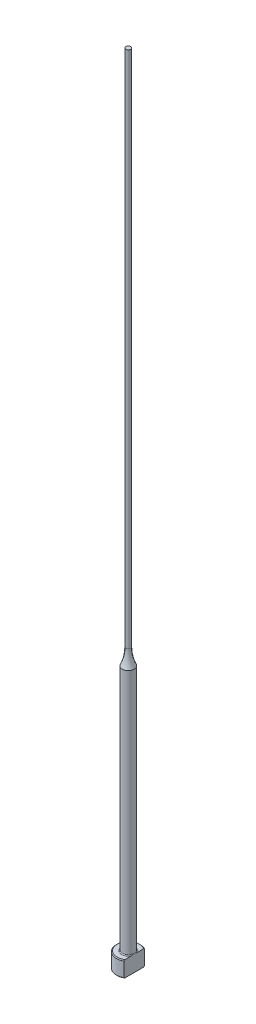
ISO-10303-21;
HEADER;
FILE_DESCRIPTION(('STEP AP214'),'2;1');
FILE_NAME('part.step','',(''),(''),'','','');
FILE_SCHEMA(('AUTOMOTIVE_DESIGN { 1 0 10303 214 1 1 1 1 }'));
ENDSEC;
DATA;
#1=APPLICATION_CONTEXT('core data for automotive mechanical design processes');
#2=APPLICATION_PROTOCOL_DEFINITION('international standard','automotive_design',2000,#1);
#3=PRODUCT_CONTEXT('',#1,'mechanical');
#4=PRODUCT('Part','Part','',(#3));
#5=PRODUCT_RELATED_PRODUCT_CATEGORY('part','',(#4));
#6=PRODUCT_DEFINITION_FORMATION('','',#4);
#7=PRODUCT_DEFINITION_CONTEXT('part definition',#1,'design');
#8=PRODUCT_DEFINITION('design','',#6,#7);
#9=PRODUCT_DEFINITION_SHAPE('','',#8);
#10=(LENGTH_UNIT() NAMED_UNIT(*) SI_UNIT(.MILLI.,.METRE.));
#11=(NAMED_UNIT(*) PLANE_ANGLE_UNIT() SI_UNIT($,.RADIAN.));
#12=(NAMED_UNIT(*) SI_UNIT($,.STERADIAN.) SOLID_ANGLE_UNIT());
#13=UNCERTAINTY_MEASURE_WITH_UNIT(LENGTH_MEASURE(1.E-05),#10,'distance_accuracy_value','');
#14=(GEOMETRIC_REPRESENTATION_CONTEXT(3) GLOBAL_UNCERTAINTY_ASSIGNED_CONTEXT((#13)) GLOBAL_UNIT_ASSIGNED_CONTEXT((#10,
#11,#12)) REPRESENTATION_CONTEXT('',''));
#15=CARTESIAN_POINT('',(0.,0.,0.));
#16=DIRECTION('',(0.,0.,1.));
#17=DIRECTION('',(1.,0.,0.));
#18=AXIS2_PLACEMENT_3D('',#15,#16,#17);
#19=CARTESIAN_POINT('',(-2.99999999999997,4.,0.));
#20=DIRECTION('',(0.,1.,0.));
#21=DIRECTION('',(0.,0.,1.));
#22=AXIS2_PLACEMENT_3D('',#19,#20,#21);
#23=PLANE('',#22);
#24=CARTESIAN_POINT('',(0.,4.,0.));
#25=DIRECTION('',(0.,1.,0.));
#26=DIRECTION('',(0.,0.,1.));
#27=AXIS2_PLACEMENT_3D('',#24,#25,#26);
#28=CIRCLE('',#27,2.79999999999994);
#29=CARTESIAN_POINT('',(1.49999999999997,4.,-2.36431808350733));
#30=VERTEX_POINT('',#29);
#31=CARTESIAN_POINT('',(1.49999999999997,4.,2.36431808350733));
#32=VERTEX_POINT('',#31);
#33=EDGE_CURVE('E187',#30,#32,#28,.T.);
#34=ORIENTED_EDGE('',*,*,#33,.T.);
#35=DIRECTION('',(0.,0.,-1.));
#36=VECTOR('',#35,1.);
#37=CARTESIAN_POINT('',(1.49999999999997,4.,0.));
#38=LINE('',#37,#36);
#39=CARTESIAN_POINT('',(1.49999999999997,3.99999999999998,0.799999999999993));
#40=VERTEX_POINT('',#39);
#41=EDGE_CURVE('E57',#32,#40,#38,.T.);
#42=ORIENTED_EDGE('',*,*,#41,.T.);
#43=CARTESIAN_POINT('',(0.,4.,0.));
#44=DIRECTION('',(0.,1.,0.));
#45=DIRECTION('',(0.,0.,1.));
#46=AXIS2_PLACEMENT_3D('',#43,#44,#45);
#47=CIRCLE('',#46,1.69999999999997);
#48=CARTESIAN_POINT('',(1.49999999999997,3.99999999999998,-0.799999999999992));
#49=VERTEX_POINT('',#48);
#50=EDGE_CURVE('E108',#40,#49,#47,.F.);
#51=ORIENTED_EDGE('',*,*,#50,.T.);
#52=EDGE_CURVE('E137',#49,#30,#38,.T.);
#53=ORIENTED_EDGE('',*,*,#52,.T.);
#54=EDGE_LOOP('',(#34,#42,#51,#53));
#55=FACE_BOUND('',#54,.T.);
#56=ADVANCED_FACE('F32',(#55),#23,.T.);
#57=CARTESIAN_POINT('',(0.,259.958771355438,0.));
#58=DIRECTION('',(0.,1.,0.));
#59=DIRECTION('',(0.,0.,1.));
#60=AXIS2_PLACEMENT_3D('',#57,#58,#59);
#61=CYLINDRICAL_SURFACE('',#60,2.99999999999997);
#62=CARTESIAN_POINT('',(0.,3.79999999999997,0.));
#63=DIRECTION('',(0.,1.,0.));
#64=DIRECTION('',(0.,0.,1.));
#65=AXIS2_PLACEMENT_3D('',#62,#63,#64);
#66=CIRCLE('',#65,2.99999999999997);
#67=CARTESIAN_POINT('',(1.49999999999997,3.79999999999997,2.5980762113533));
#68=VERTEX_POINT('',#67);
#69=CARTESIAN_POINT('',(1.49999999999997,3.79999999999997,-2.5980762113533));
#70=VERTEX_POINT('',#69);
#71=EDGE_CURVE('E105',#68,#70,#66,.F.);
#72=ORIENTED_EDGE('',*,*,#71,.T.);
#73=DIRECTION('',(0.,-1.,0.));
#74=VECTOR('',#73,1.);
#75=CARTESIAN_POINT('',(1.49999999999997,200.,-2.5980762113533));
#76=LINE('',#75,#74);
#77=CARTESIAN_POINT('',(1.49999999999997,0.200000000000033,-2.5980762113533));
#78=VERTEX_POINT('',#77);
#79=EDGE_CURVE('E193',#70,#78,#76,.T.);
#80=ORIENTED_EDGE('',*,*,#79,.T.);
#81=CARTESIAN_POINT('',(0.,0.200000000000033,0.));
#82=DIRECTION('',(0.,-1.,0.));
#83=DIRECTION('',(0.,0.,-1.));
#84=AXIS2_PLACEMENT_3D('',#81,#82,#83);
#85=CIRCLE('',#84,2.99999999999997);
#86=CARTESIAN_POINT('',(1.49999999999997,0.200000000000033,2.5980762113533));
#87=VERTEX_POINT('',#86);
#88=EDGE_CURVE('E100',#78,#87,#85,.F.);
#89=ORIENTED_EDGE('',*,*,#88,.T.);
#90=DIRECTION('',(0.,-1.,0.));
#91=VECTOR('',#90,1.);
#92=CARTESIAN_POINT('',(1.49999999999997,200.,2.5980762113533));
#93=LINE('',#92,#91);
#94=EDGE_CURVE('E93',#68,#87,#93,.T.);
#95=ORIENTED_EDGE('',*,*,#94,.F.);
#96=EDGE_LOOP('',(#72,#80,#89,#95));
#97=FACE_BOUND('',#96,.T.);
#98=ADVANCED_FACE('F158',(#97),#61,.T.);
#99=CARTESIAN_POINT('',(0.,0.,0.));
#100=DIRECTION('',(0.,-1.,0.));
#101=DIRECTION('',(0.,0.,-1.));
#102=AXIS2_PLACEMENT_3D('',#99,#100,#101);
#103=PLANE('',#102);
#104=CARTESIAN_POINT('',(0.,0.,0.));
#105=DIRECTION('',(0.,-1.,0.));
#106=DIRECTION('',(0.,0.,-1.));
#107=AXIS2_PLACEMENT_3D('',#104,#105,#106);
#108=CIRCLE('',#107,2.79999999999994);
#109=CARTESIAN_POINT('',(1.49999999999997,0.,2.36431808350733));
#110=VERTEX_POINT('',#109);
#111=CARTESIAN_POINT('',(1.49999999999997,0.,-2.36431808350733));
#112=VERTEX_POINT('',#111);
#113=EDGE_CURVE('E98',#110,#112,#108,.T.);
#114=ORIENTED_EDGE('',*,*,#113,.T.);
#115=DIRECTION('',(0.,0.,1.));
#116=VECTOR('',#115,1.);
#117=CARTESIAN_POINT('',(1.49999999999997,0.,2.5980762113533));
#118=LINE('',#117,#116);
#119=EDGE_CURVE('E83',#112,#110,#118,.T.);
#120=ORIENTED_EDGE('',*,*,#119,.T.);
#121=EDGE_LOOP('',(#114,#120));
#122=FACE_BOUND('',#121,.T.);
#123=ADVANCED_FACE('F103',(#122),#103,.T.);
#124=CARTESIAN_POINT('',(0.,4.,0.));
#125=DIRECTION('',(0.,-1.,0.));
#126=DIRECTION('',(0.,0.,-1.));
#127=AXIS2_PLACEMENT_3D('',#124,#125,#126);
#128=CONICAL_SURFACE('',#127,2.79999999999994,0.785398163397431);
#129=ORIENTED_EDGE('',*,*,#71,.F.);
#130=CARTESIAN_POINT('',(1.49999999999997,0.888258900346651,5.71827621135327));
#131=CARTESIAN_POINT('',(1.49999999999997,1.01361833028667,5.58866816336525));
#132=CARTESIAN_POINT('',(1.49999999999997,1.13884324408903,5.45892957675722));
#133=CARTESIAN_POINT('',(1.49999999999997,1.38894444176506,5.19911365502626));
#134=CARTESIAN_POINT('',(1.49999999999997,1.51382072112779,5.06903631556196));
#135=CARTESIAN_POINT('',(1.49999999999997,1.76320568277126,4.80840180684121));
#136=CARTESIAN_POINT('',(1.49999999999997,1.88771414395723,4.67784442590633));
#137=CARTESIAN_POINT('',(1.49999999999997,2.13618059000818,4.4162081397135));
#138=CARTESIAN_POINT('',(1.49999999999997,2.26013857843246,4.28512923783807));
#139=CARTESIAN_POINT('',(1.49999999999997,2.50488975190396,4.02490837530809));
#140=CARTESIAN_POINT('',(1.49999999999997,2.62569693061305,3.8957795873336));
#141=CARTESIAN_POINT('',(1.49999999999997,2.86640694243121,3.63668213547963));
#142=CARTESIAN_POINT('',(1.49999999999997,2.98630978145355,3.50671347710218));
#143=CARTESIAN_POINT('',(1.49999999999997,3.22486033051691,3.24567921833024));
#144=CARTESIAN_POINT('',(1.49999999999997,3.3435083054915,3.11461386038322));
#145=CARTESIAN_POINT('',(1.49999999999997,3.5790771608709,2.85094268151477));
#146=CARTESIAN_POINT('',(1.49999999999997,3.69599811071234,2.71833692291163));
#147=CARTESIAN_POINT('',(1.49999999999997,3.88262371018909,2.50255231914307));
#148=CARTESIAN_POINT('',(1.49999999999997,3.95312454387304,2.42006293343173));
#149=CARTESIAN_POINT('',(1.49999999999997,4.09287098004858,2.254010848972));
#150=CARTESIAN_POINT('',(1.49999999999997,4.16211645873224,2.17044804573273));
#151=CARTESIAN_POINT('',(1.49999999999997,4.29964684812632,2.00105967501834));
#152=CARTESIAN_POINT('',(1.49999999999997,4.36791386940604,1.9152195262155));
#153=CARTESIAN_POINT('',(1.49999999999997,4.50205840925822,1.7417139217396));
#154=CARTESIAN_POINT('',(1.49999999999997,4.56793649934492,1.65404891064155));
#155=CARTESIAN_POINT('',(1.49999999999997,4.69728151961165,1.47490236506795));
#156=CARTESIAN_POINT('',(1.49999999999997,4.76069661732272,1.38338308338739));
#157=CARTESIAN_POINT('',(1.49999999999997,4.88239539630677,1.19675661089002));
#158=CARTESIAN_POINT('',(1.49999999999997,4.94067201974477,1.10164473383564));
#159=CARTESIAN_POINT('',(1.49999999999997,5.048413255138,0.908008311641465));
#160=CARTESIAN_POINT('',(1.49999999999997,5.09797809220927,0.809540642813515));
#161=CARTESIAN_POINT('',(1.49999999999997,5.18432188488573,0.607192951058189));
#162=CARTESIAN_POINT('',(1.49999999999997,5.22114374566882,0.50333247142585));
#163=CARTESIAN_POINT('',(1.49999999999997,5.26099935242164,0.347577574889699));
#164=CARTESIAN_POINT('',(1.49999999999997,5.2715702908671,0.297609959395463));
#165=CARTESIAN_POINT('',(1.49999999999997,5.28794860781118,0.196885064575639));
#166=CARTESIAN_POINT('',(1.49999999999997,5.29375640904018,0.146127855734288));
#167=CARTESIAN_POINT('',(1.49999999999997,5.30019707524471,0.0444388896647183));
#168=CARTESIAN_POINT('',(1.49999999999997,5.30084594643,-0.00649183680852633));
#169=CARTESIAN_POINT('',(1.49999999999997,5.29696416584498,-0.108155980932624));
#170=CARTESIAN_POINT('',(1.49999999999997,5.29243308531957,-0.158889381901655));
#171=CARTESIAN_POINT('',(1.49999999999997,5.27856915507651,-0.259234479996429));
#172=CARTESIAN_POINT('',(1.49999999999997,5.2692782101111,-0.308852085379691));
#173=CARTESIAN_POINT('',(1.49999999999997,5.24647108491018,-0.407110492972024));
#174=CARTESIAN_POINT('',(1.49999999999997,5.23295324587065,-0.45575090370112));
#175=CARTESIAN_POINT('',(1.49999999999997,5.20226175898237,-0.55214996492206));
#176=CARTESIAN_POINT('',(1.49999999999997,5.18506801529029,-0.599902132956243));
#177=CARTESIAN_POINT('',(1.49999999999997,5.1477138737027,-0.694205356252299));
#178=CARTESIAN_POINT('',(1.49999999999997,5.12755408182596,-0.740756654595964));
#179=CARTESIAN_POINT('',(1.49999999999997,5.0632769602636,-0.879166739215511));
#180=CARTESIAN_POINT('',(1.49999999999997,5.01551721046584,-0.969329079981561));
#181=CARTESIAN_POINT('',(1.49999999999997,4.91367909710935,-1.14604316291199));
#182=CARTESIAN_POINT('',(1.49999999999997,4.85959300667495,-1.2325903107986));
#183=CARTESIAN_POINT('',(1.49999999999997,4.74697968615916,-1.40321348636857));
#184=CARTESIAN_POINT('',(1.49999999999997,4.68843573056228,-1.4872783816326));
#185=CARTESIAN_POINT('',(1.49999999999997,4.5684384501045,-1.65322187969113));
#186=CARTESIAN_POINT('',(1.49999999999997,4.50698656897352,-1.73510153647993));
#187=CARTESIAN_POINT('',(1.49999999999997,4.3811567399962,-1.89829823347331));
#188=CARTESIAN_POINT('',(1.49999999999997,4.31675092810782,-1.97959369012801));
#189=CARTESIAN_POINT('',(1.49999999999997,4.18634068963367,-2.14090082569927));
#190=CARTESIAN_POINT('',(1.49999999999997,4.12033609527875,-2.22091236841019));
#191=CARTESIAN_POINT('',(1.49999999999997,3.92086431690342,-2.45906508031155));
#192=CARTESIAN_POINT('',(1.49999999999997,3.78562663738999,-2.61572090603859));
#193=CARTESIAN_POINT('',(1.49999999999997,3.53554498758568,-2.90006295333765));
#194=CARTESIAN_POINT('',(1.49999999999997,3.42114543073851,-3.02814382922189));
#195=CARTESIAN_POINT('',(1.49999999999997,3.1909355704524,-3.28303767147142));
#196=CARTESIAN_POINT('',(1.49999999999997,3.07512522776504,-3.40985060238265));
#197=CARTESIAN_POINT('',(1.49999999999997,2.72597067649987,-3.78913849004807));
#198=CARTESIAN_POINT('',(1.49999999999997,2.49111760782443,-4.04022177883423));
#199=CARTESIAN_POINT('',(1.49999999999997,2.0288247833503,-4.52992803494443));
#200=CARTESIAN_POINT('',(1.49999999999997,1.80147747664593,-4.7686387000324));
#201=CARTESIAN_POINT('',(1.49999999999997,1.45954865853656,-5.12558036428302));
#202=CARTESIAN_POINT('',(1.49999999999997,1.34548484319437,-5.24430773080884));
#203=CARTESIAN_POINT('',(1.49999999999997,1.11707176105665,-5.48148573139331));
#204=CARTESIAN_POINT('',(1.49999999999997,1.00272249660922,-5.59993636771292));
#205=CARTESIAN_POINT('',(1.49999999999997,0.888258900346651,-5.71827621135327));
#206=B_SPLINE_CURVE_WITH_KNOTS('',3,(#130,#131,#132,#133,#134,#135,#136,#137,#138,#139,#140,
#141,#142,#143,#144,#145,#146,#147,#148,#149,#150,#151,#152,#153,#154,#155,#156,#157,#158,#159,
#160,#161,#162,#163,#164,#165,#166,#167,#168,#169,#170,#171,#172,#173,#174,#175,#176,#177,#178,
#179,#180,#181,#182,#183,#184,#185,#186,#187,#188,#189,#190,#191,#192,#193,#194,#195,#196,#197,
#198,#199,#200,#201,#202,#203,#204,#205),.UNSPECIFIED.,.F.,.F.,(4,2,2,2,2,2,2,2,2,2,2,2,2,2,2,2,
2,2,2,2,2,2,2,2,2,2,2,2,2,2,2,2,2,2,2,2,2,4),(0.,0.540943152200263,1.08189327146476,
1.62312052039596,2.16434426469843,2.69482920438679,3.22531067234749,3.75567781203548,
4.28602356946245,4.611550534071,4.9371094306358,5.26610945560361,5.59503024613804,
5.92894782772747,6.26331713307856,6.59354403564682,6.92264800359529,7.07567478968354,
7.22868799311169,7.38122626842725,7.53377717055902,7.68500755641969,7.83629736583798,
7.988436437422,8.14054446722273,8.44618799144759,8.75220879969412,9.05944044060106,
9.36652111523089,9.6776428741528,9.98879742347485,10.609592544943,11.1247803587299,
11.6399825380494,12.6713544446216,13.6603005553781,14.1542238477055,14.6481430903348),.UNSPECIFIED.);
#207=EDGE_CURVE('E136',#68,#32,#206,.T.);
#208=ORIENTED_EDGE('',*,*,#207,.T.);
#209=ORIENTED_EDGE('',*,*,#33,.F.);
#210=EDGE_CURVE('E128',#30,#70,#206,.T.);
#211=ORIENTED_EDGE('',*,*,#210,.T.);
#212=EDGE_LOOP('',(#129,#208,#209,#211));
#213=FACE_BOUND('',#212,.T.);
#214=ADVANCED_FACE('F144',(#213),#128,.T.);
#215=CARTESIAN_POINT('',(0.,0.200000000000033,0.));
#216=DIRECTION('',(0.,1.,0.));
#217=DIRECTION('',(0.,0.,1.));
#218=AXIS2_PLACEMENT_3D('',#215,#216,#217);
#219=CONICAL_SURFACE('',#218,2.99999999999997,0.785398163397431);
#220=ORIENTED_EDGE('',*,*,#88,.F.);
#221=CARTESIAN_POINT('',(1.49999999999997,3.11174109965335,-5.71827621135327));
#222=CARTESIAN_POINT('',(1.49999999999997,2.98638166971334,-5.58866816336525));
#223=CARTESIAN_POINT('',(1.49999999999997,2.86115675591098,-5.45892957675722));
#224=CARTESIAN_POINT('',(1.49999999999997,2.61105555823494,-5.19911365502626));
#225=CARTESIAN_POINT('',(1.49999999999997,2.48617927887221,-5.06903631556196));
#226=CARTESIAN_POINT('',(1.49999999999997,2.23679431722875,-4.80840180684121));
#227=CARTESIAN_POINT('',(1.49999999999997,2.11228585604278,-4.67784442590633));
#228=CARTESIAN_POINT('',(1.49999999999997,1.86381940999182,-4.4162081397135));
#229=CARTESIAN_POINT('',(1.49999999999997,1.73986142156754,-4.28512923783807));
#230=CARTESIAN_POINT('',(1.49999999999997,1.49511024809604,-4.02490837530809));
#231=CARTESIAN_POINT('',(1.49999999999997,1.37430306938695,-3.8957795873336));
#232=CARTESIAN_POINT('',(1.49999999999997,1.13359305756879,-3.63668213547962));
#233=CARTESIAN_POINT('',(1.49999999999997,1.01369021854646,-3.50671347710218));
#234=CARTESIAN_POINT('',(1.49999999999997,0.775139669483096,-3.24567921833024));
#235=CARTESIAN_POINT('',(1.49999999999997,0.656491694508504,-3.11461386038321));
#236=CARTESIAN_POINT('',(1.49999999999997,0.420922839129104,-2.85094268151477));
#237=CARTESIAN_POINT('',(1.49999999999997,0.304001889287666,-2.71833692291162));
#238=CARTESIAN_POINT('',(1.49999999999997,0.117376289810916,-2.50255231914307));
#239=CARTESIAN_POINT('',(1.49999999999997,0.0468754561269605,-2.42006293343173));
#240=CARTESIAN_POINT('',(1.49999999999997,-0.0928709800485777,-2.254010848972));
#241=CARTESIAN_POINT('',(1.49999999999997,-0.162116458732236,-2.17044804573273));
#242=CARTESIAN_POINT('',(1.49999999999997,-0.299646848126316,-2.00105967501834));
#243=CARTESIAN_POINT('',(1.49999999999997,-0.367913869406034,-1.9152195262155));
#244=CARTESIAN_POINT('',(1.49999999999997,-0.502058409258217,-1.7417139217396));
#245=CARTESIAN_POINT('',(1.49999999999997,-0.567936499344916,-1.65404891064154));
#246=CARTESIAN_POINT('',(1.49999999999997,-0.697281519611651,-1.47490236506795));
#247=CARTESIAN_POINT('',(1.49999999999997,-0.760696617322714,-1.38338308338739));
#248=CARTESIAN_POINT('',(1.49999999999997,-0.882395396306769,-1.19675661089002));
#249=CARTESIAN_POINT('',(1.49999999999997,-0.940672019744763,-1.10164473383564));
#250=CARTESIAN_POINT('',(1.49999999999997,-1.048413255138,-0.908008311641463));
#251=CARTESIAN_POINT('',(1.49999999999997,-1.09797809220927,-0.809540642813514));
#252=CARTESIAN_POINT('',(1.49999999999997,-1.18432188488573,-0.607192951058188));
#253=CARTESIAN_POINT('',(1.49999999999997,-1.22114374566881,-0.503332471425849));
#254=CARTESIAN_POINT('',(1.49999999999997,-1.26099935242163,-0.347577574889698));
#255=CARTESIAN_POINT('',(1.49999999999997,-1.2715702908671,-0.297609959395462));
#256=CARTESIAN_POINT('',(1.49999999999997,-1.28794860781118,-0.196885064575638));
#257=CARTESIAN_POINT('',(1.49999999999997,-1.29375640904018,-0.146127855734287));
#258=CARTESIAN_POINT('',(1.49999999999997,-1.30019707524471,-0.0444388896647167));
#259=CARTESIAN_POINT('',(1.49999999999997,-1.30084594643,0.00649183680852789));
#260=CARTESIAN_POINT('',(1.49999999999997,-1.29696416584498,0.108155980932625));
#261=CARTESIAN_POINT('',(1.49999999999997,-1.29243308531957,0.158889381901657));
#262=CARTESIAN_POINT('',(1.49999999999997,-1.2785691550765,0.259234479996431));
#263=CARTESIAN_POINT('',(1.49999999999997,-1.2692782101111,0.308852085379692));
#264=CARTESIAN_POINT('',(1.49999999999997,-1.24647108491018,0.407110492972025));
#265=CARTESIAN_POINT('',(1.49999999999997,-1.23295324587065,0.455750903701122));
#266=CARTESIAN_POINT('',(1.49999999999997,-1.20226175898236,0.552149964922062));
#267=CARTESIAN_POINT('',(1.49999999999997,-1.18506801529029,0.599902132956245));
#268=CARTESIAN_POINT('',(1.49999999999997,-1.14771387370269,0.694205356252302));
#269=CARTESIAN_POINT('',(1.49999999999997,-1.12755408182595,0.740756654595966));
#270=CARTESIAN_POINT('',(1.49999999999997,-1.0632769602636,0.879166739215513));
#271=CARTESIAN_POINT('',(1.49999999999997,-1.01551721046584,0.969329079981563));
#272=CARTESIAN_POINT('',(1.49999999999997,-0.913679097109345,1.14604316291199));
#273=CARTESIAN_POINT('',(1.49999999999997,-0.859593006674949,1.2325903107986));
#274=CARTESIAN_POINT('',(1.49999999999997,-0.746979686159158,1.40321348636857));
#275=CARTESIAN_POINT('',(1.49999999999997,-0.688435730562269,1.4872783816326));
#276=CARTESIAN_POINT('',(1.49999999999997,-0.568438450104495,1.65322187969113));
#277=CARTESIAN_POINT('',(1.49999999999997,-0.506986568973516,1.73510153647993));
#278=CARTESIAN_POINT('',(1.49999999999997,-0.381156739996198,1.89829823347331));
#279=CARTESIAN_POINT('',(1.49999999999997,-0.316750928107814,1.97959369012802));
#280=CARTESIAN_POINT('',(1.49999999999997,-0.186340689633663,2.14090082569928));
#281=CARTESIAN_POINT('',(1.49999999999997,-0.12033609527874,2.22091236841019));
#282=CARTESIAN_POINT('',(1.49999999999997,0.0791356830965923,2.45906508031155));
#283=CARTESIAN_POINT('',(1.49999999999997,0.214373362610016,2.61572090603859));
#284=CARTESIAN_POINT('',(1.49999999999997,0.46445501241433,2.90006295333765));
#285=CARTESIAN_POINT('',(1.49999999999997,0.578854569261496,3.02814382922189));
#286=CARTESIAN_POINT('',(1.49999999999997,0.809064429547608,3.28303767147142));
#287=CARTESIAN_POINT('',(1.49999999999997,0.924874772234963,3.40985060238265));
#288=CARTESIAN_POINT('',(1.49999999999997,1.27402932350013,3.78913849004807));
#289=CARTESIAN_POINT('',(1.49999999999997,1.50888239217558,4.04022177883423));
#290=CARTESIAN_POINT('',(1.49999999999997,1.97117521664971,4.52992803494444));
#291=CARTESIAN_POINT('',(1.49999999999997,2.19852252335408,4.76863870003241));
#292=CARTESIAN_POINT('',(1.49999999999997,2.54045134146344,5.12558036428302));
#293=CARTESIAN_POINT('',(1.49999999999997,2.65451515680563,5.24430773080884));
#294=CARTESIAN_POINT('',(1.49999999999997,2.88292823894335,5.48148573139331));
#295=CARTESIAN_POINT('',(1.49999999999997,2.99727750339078,5.59993636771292));
#296=CARTESIAN_POINT('',(1.49999999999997,3.11174109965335,5.71827621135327));
#297=B_SPLINE_CURVE_WITH_KNOTS('',3,(#221,#222,#223,#224,#225,#226,#227,#228,#229,#230,#231,
#232,#233,#234,#235,#236,#237,#238,#239,#240,#241,#242,#243,#244,#245,#246,#247,#248,#249,#250,
#251,#252,#253,#254,#255,#256,#257,#258,#259,#260,#261,#262,#263,#264,#265,#266,#267,#268,#269,
#270,#271,#272,#273,#274,#275,#276,#277,#278,#279,#280,#281,#282,#283,#284,#285,#286,#287,#288,
#289,#290,#291,#292,#293,#294,#295,#296),.UNSPECIFIED.,.F.,.F.,(4,2,2,2,2,2,2,2,2,2,2,2,2,2,2,2,
2,2,2,2,2,2,2,2,2,2,2,2,2,2,2,2,2,2,2,2,2,4),(0.,0.540943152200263,1.08189327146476,
1.62312052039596,2.16434426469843,2.69482920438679,3.22531067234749,3.75567781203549,
4.28602356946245,4.611550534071,4.9371094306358,5.26610945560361,5.59503024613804,
5.92894782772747,6.26331713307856,6.59354403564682,6.92264800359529,7.07567478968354,
7.2286879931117,7.38122626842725,7.53377717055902,7.6850075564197,7.83629736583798,
7.98843643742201,8.14054446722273,8.44618799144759,8.75220879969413,9.05944044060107,
9.3665211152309,9.6776428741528,9.98879742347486,10.609592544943,11.1247803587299,
11.6399825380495,12.6713544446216,13.6603005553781,14.1542238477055,14.6481430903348),.UNSPECIFIED.);
#298=EDGE_CURVE('E86',#78,#112,#297,.T.);
#299=ORIENTED_EDGE('',*,*,#298,.T.);
#300=ORIENTED_EDGE('',*,*,#113,.F.);
#301=EDGE_CURVE('E89',#110,#87,#297,.T.);
#302=ORIENTED_EDGE('',*,*,#301,.T.);
#303=EDGE_LOOP('',(#220,#299,#300,#302));
#304=FACE_BOUND('',#303,.T.);
#305=ADVANCED_FACE('F97',(#304),#219,.T.);
#306=CARTESIAN_POINT('',(0.,4.19999999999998,0.));
#307=DIRECTION('',(0.,1.,0.));
#308=DIRECTION('',(0.,0.,1.));
#309=AXIS2_PLACEMENT_3D('',#306,#307,#308);
#310=TOROIDAL_SURFACE('',#309,1.69999999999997,0.2);
#311=CARTESIAN_POINT('',(1.49999999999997,4.19999999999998,0.));
#312=CARTESIAN_POINT('',(1.49999999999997,4.20000050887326,7.14686674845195E-11));
#313=CARTESIAN_POINT('',(1.49999999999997,4.20000101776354,-1.21663673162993E-07));
#314=CARTESIAN_POINT('',(1.49999999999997,4.20000199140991,-4.97616237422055E-07));
#315=CARTESIAN_POINT('',(1.49999999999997,4.20000245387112,-7.56516220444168E-07));
#316=CARTESIAN_POINT('',(1.49999999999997,4.20000338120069,-1.37642837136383E-06));
#317=CARTESIAN_POINT('',(1.49999999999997,4.20000384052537,-1.74563476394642E-06));
#318=CARTESIAN_POINT('',(1.49999999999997,4.20000469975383,-2.53565984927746E-06));
#319=CARTESIAN_POINT('',(1.49999999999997,4.20000510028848,-2.95582597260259E-06));
#320=CARTESIAN_POINT('',(1.49999999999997,4.20000646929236,-4.48430445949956E-06));
#321=CARTESIAN_POINT('',(1.49999999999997,4.20000736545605,-5.6586103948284E-06));
#322=CARTESIAN_POINT('',(1.49999999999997,4.20000893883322,-8.06479202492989E-06));
#323=CARTESIAN_POINT('',(1.49999999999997,4.20000962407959,-9.29170517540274E-06));
#324=CARTESIAN_POINT('',(1.49999999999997,4.20001225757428,-1.416232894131E-05));
#325=CARTESIAN_POINT('',(1.49999999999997,4.20001407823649,-1.78790031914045E-05));
#326=CARTESIAN_POINT('',(1.49999999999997,4.20001699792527,-2.51443066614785E-05));
#327=CARTESIAN_POINT('',(1.49999999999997,4.20001815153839,-2.86715394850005E-05));
#328=CARTESIAN_POINT('',(1.49999999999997,4.20002315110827,-4.39218128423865E-05));
#329=CARTESIAN_POINT('',(1.49999999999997,4.20002701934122,-5.56288390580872E-05));
#330=CARTESIAN_POINT('',(1.49999999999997,4.20003312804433,-7.7405829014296E-05));
#331=CARTESIAN_POINT('',(1.49999999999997,4.20003553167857,-8.74278412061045E-05));
#332=CARTESIAN_POINT('',(1.49999999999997,4.20005483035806,-0.000161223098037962));
#333=CARTESIAN_POINT('',(1.49999999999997,4.20007979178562,-0.000222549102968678));
#334=CARTESIAN_POINT('',(1.49999999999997,4.20017391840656,-0.000462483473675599));
#335=CARTESIAN_POINT('',(1.49999999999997,4.20023706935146,-0.000642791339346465));
#336=CARTESIAN_POINT('',(1.49999999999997,4.20048761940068,-0.00134785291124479));
#337=CARTESIAN_POINT('',(1.49999999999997,4.20068132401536,-0.00187087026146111));
#338=CARTESIAN_POINT('',(1.49999999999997,4.20147357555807,-0.00402004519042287));
#339=CARTESIAN_POINT('',(1.49999999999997,4.20206499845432,-0.0056481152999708));
#340=CARTESIAN_POINT('',(1.49999999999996,4.20892634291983,-0.0245232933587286));
#341=CARTESIAN_POINT('',(1.49999999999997,4.21523683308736,-0.041759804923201));
#342=CARTESIAN_POINT('',(1.49999999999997,4.22755028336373,-0.0756091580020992));
#343=CARTESIAN_POINT('',(1.49999999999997,4.23355589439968,-0.0922211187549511));
#344=CARTESIAN_POINT('',(1.49999999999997,4.24620101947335,-0.127454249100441));
#345=CARTESIAN_POINT('',(1.49999999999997,4.25283080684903,-0.146078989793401));
#346=CARTESIAN_POINT('',(1.49999999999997,4.26599765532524,-0.183577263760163));
#347=CARTESIAN_POINT('',(1.49999999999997,4.27253305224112,-0.202451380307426));
#348=CARTESIAN_POINT('',(1.49999999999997,4.28834228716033,-0.248982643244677));
#349=CARTESIAN_POINT('',(1.49999999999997,4.2974915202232,-0.276682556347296));
#350=CARTESIAN_POINT('',(1.49999999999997,4.31490935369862,-0.331625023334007));
#351=CARTESIAN_POINT('',(1.49999999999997,4.3231938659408,-0.358862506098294));
#352=CARTESIAN_POINT('',(1.49999999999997,4.34051594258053,-0.419125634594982));
#353=CARTESIAN_POINT('',(1.49999999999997,4.34936607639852,-0.452206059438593));
#354=CARTESIAN_POINT('',(1.49999999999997,4.36549583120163,-0.519023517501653));
#355=CARTESIAN_POINT('',(1.49999999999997,4.37276283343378,-0.552763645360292));
#356=CARTESIAN_POINT('',(1.49999999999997,4.38554755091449,-0.62305310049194));
#357=CARTESIAN_POINT('',(1.49999999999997,4.39090573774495,-0.65963271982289));
#358=CARTESIAN_POINT('',(1.49999999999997,4.39825016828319,-0.733028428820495));
#359=CARTESIAN_POINT('',(1.49999999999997,4.40024734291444,-0.76984335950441));
#360=CARTESIAN_POINT('',(1.49999999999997,4.39970780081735,-0.842856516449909));
#361=CARTESIAN_POINT('',(1.49999999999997,4.39725347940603,-0.879053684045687));
#362=CARTESIAN_POINT('',(1.49999999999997,4.38900085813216,-0.93238076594));
#363=CARTESIAN_POINT('',(1.49999999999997,4.38553049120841,-0.949868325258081));
#364=CARTESIAN_POINT('',(1.49999999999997,4.37678336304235,-0.984374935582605));
#365=CARTESIAN_POINT('',(1.49999999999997,4.37150943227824,-1.00139467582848));
#366=CARTESIAN_POINT('',(1.49999999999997,4.35869781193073,-1.03479423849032));
#367=CARTESIAN_POINT('',(1.49999999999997,4.3511359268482,-1.05116499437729));
#368=CARTESIAN_POINT('',(1.49999999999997,4.33325333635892,-1.08234828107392));
#369=CARTESIAN_POINT('',(1.49999999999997,4.32294266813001,-1.09716621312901));
#370=CARTESIAN_POINT('',(1.49999999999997,4.30512758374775,-1.11714173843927));
#371=CARTESIAN_POINT('',(1.49999999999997,4.29884721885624,-1.12339066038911));
#372=CARTESIAN_POINT('',(1.49999999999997,4.28545950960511,-1.13494695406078));
#373=CARTESIAN_POINT('',(1.49999999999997,4.27835226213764,-1.14025443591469));
#374=CARTESIAN_POINT('',(1.49999999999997,4.26325970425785,-1.14967631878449));
#375=CARTESIAN_POINT('',(1.49999999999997,4.25526534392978,-1.15377649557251));
#376=CARTESIAN_POINT('',(1.49999999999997,4.23863207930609,-1.16034952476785));
#377=CARTESIAN_POINT('',(1.49999999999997,4.22999427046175,-1.16282507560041));
#378=CARTESIAN_POINT('',(1.49999999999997,4.21343922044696,-1.16570267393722));
#379=CARTESIAN_POINT('',(1.49999999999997,4.20555896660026,-1.16631687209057));
#380=CARTESIAN_POINT('',(1.49999999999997,4.18982775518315,-1.16602054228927));
#381=CARTESIAN_POINT('',(1.49999999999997,4.18197679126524,-1.16511036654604));
#382=CARTESIAN_POINT('',(1.49999999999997,4.16747846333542,-1.16204446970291));
#383=CARTESIAN_POINT('',(1.49999999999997,4.16079696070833,-1.16004509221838));
#384=CARTESIAN_POINT('',(1.49999999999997,4.14781700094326,-1.15505972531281));
#385=CARTESIAN_POINT('',(1.49999999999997,4.14151862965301,-1.1520735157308));
#386=CARTESIAN_POINT('',(1.49999999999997,4.12690214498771,-1.14387585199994));
#387=CARTESIAN_POINT('',(1.49999999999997,4.11881436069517,-1.13825400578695));
#388=CARTESIAN_POINT('',(1.49999999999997,4.1036444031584,-1.12578441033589));
#389=CARTESIAN_POINT('',(1.49999999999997,4.09656475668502,-1.11893367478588));
#390=CARTESIAN_POINT('',(1.49999999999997,4.08012297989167,-1.10074342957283));
#391=CARTESIAN_POINT('',(1.49999999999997,4.07136543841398,-1.08886044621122));
#392=CARTESIAN_POINT('',(1.49999999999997,4.05578194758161,-1.06392743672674));
#393=CARTESIAN_POINT('',(1.49999999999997,4.0489571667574,-1.05087671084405));
#394=CARTESIAN_POINT('',(1.49999999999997,4.03273856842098,-1.01472307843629));
#395=CARTESIAN_POINT('',(1.49999999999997,4.02486230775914,-0.990945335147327));
#396=CARTESIAN_POINT('',(1.49999999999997,4.01257693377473,-0.94232199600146));
#397=CARTESIAN_POINT('',(1.49999999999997,4.00820590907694,-0.917467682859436));
#398=CARTESIAN_POINT('',(1.49999999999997,4.00229956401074,-0.867912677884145));
#399=CARTESIAN_POINT('',(1.49999999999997,4.0007128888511,-0.843217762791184));
#400=CARTESIAN_POINT('',(1.49999999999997,3.9996723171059,-0.79374605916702));
#401=CARTESIAN_POINT('',(1.49999999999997,4.0002230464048,-0.768969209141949));
#402=CARTESIAN_POINT('',(1.49999999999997,4.00433101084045,-0.696994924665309));
#403=CARTESIAN_POINT('',(1.49999999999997,4.01016976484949,-0.64993124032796));
#404=CARTESIAN_POINT('',(1.49999999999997,4.02567776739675,-0.559166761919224));
#405=CARTESIAN_POINT('',(1.49999999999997,4.03511950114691,-0.515423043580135));
#406=CARTESIAN_POINT('',(1.49999999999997,4.05693059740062,-0.427590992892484));
#407=CARTESIAN_POINT('',(1.49999999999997,4.06936356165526,-0.383518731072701));
#408=CARTESIAN_POINT('',(1.49999999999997,4.09174953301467,-0.310161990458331));
#409=CARTESIAN_POINT('',(1.49999999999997,4.10119843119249,-0.280718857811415));
#410=CARTESIAN_POINT('',(1.49999999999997,4.12060442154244,-0.22234098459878));
#411=CARTESIAN_POINT('',(1.49999999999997,4.13055519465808,-0.193404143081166));
#412=CARTESIAN_POINT('',(1.49999999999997,4.14973721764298,-0.138756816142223));
#413=CARTESIAN_POINT('',(1.49999999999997,4.15893123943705,-0.113033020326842));
#414=CARTESIAN_POINT('',(1.49999999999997,4.17788037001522,-0.0606351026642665));
#415=CARTESIAN_POINT('',(1.49999999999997,4.18764328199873,-0.0339636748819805));
#416=CARTESIAN_POINT('',(1.49999999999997,4.19793548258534,-0.00564657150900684));
#417=CARTESIAN_POINT('',(1.49999999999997,4.19852751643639,-0.00401699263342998));
#418=CARTESIAN_POINT('',(1.49999999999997,4.1993199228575,-0.0018674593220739));
#419=CARTESIAN_POINT('',(1.49999999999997,4.19951319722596,-0.00134559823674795));
#420=CARTESIAN_POINT('',(1.49999999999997,4.19976322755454,-0.000641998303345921));
#421=CARTESIAN_POINT('',(1.49999999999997,4.19982627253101,-0.000461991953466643));
#422=CARTESIAN_POINT('',(1.49999999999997,4.19992025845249,-0.000222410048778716));
#423=CARTESIAN_POINT('',(1.49999999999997,4.19994519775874,-0.000161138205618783));
#424=CARTESIAN_POINT('',(1.49999999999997,4.19996448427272,-8.74039267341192E-05));
#425=CARTESIAN_POINT('',(1.49999999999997,4.19996688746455,-7.73857556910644E-05));
#426=CARTESIAN_POINT('',(1.49999999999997,4.1999729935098,-5.56173272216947E-05));
#427=CARTESIAN_POINT('',(1.49999999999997,4.19997685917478,-4.39149186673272E-05));
#428=CARTESIAN_POINT('',(1.49999999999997,4.19998185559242,-2.86698156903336E-05));
#429=CARTESIAN_POINT('',(1.49999999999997,4.19998300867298,-2.51431575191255E-05));
#430=CARTESIAN_POINT('',(1.49999999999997,4.19998592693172,-1.78789552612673E-05));
#431=CARTESIAN_POINT('',(1.49999999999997,4.19998774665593,-1.41627846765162E-05));
#432=CARTESIAN_POINT('',(1.49999999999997,4.19999037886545,-9.29264488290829E-06));
#433=CARTESIAN_POINT('',(1.49999999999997,4.19999106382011,-8.06577599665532E-06));
#434=CARTESIAN_POINT('',(1.49999999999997,4.19999263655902,-5.65962639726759E-06));
#435=CARTESIAN_POINT('',(1.49999999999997,4.19999353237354,-4.48530466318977E-06));
#436=CARTESIAN_POINT('',(1.49999999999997,4.19999490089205,-2.95673740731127E-06));
#437=CARTESIAN_POINT('',(1.49999999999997,4.1999953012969,-2.53653208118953E-06));
#438=CARTESIAN_POINT('',(1.49999999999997,4.19999616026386,-1.74640525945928E-06));
#439=CARTESIAN_POINT('',(1.49999999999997,4.19999661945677,-1.37713598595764E-06));
#440=CARTESIAN_POINT('',(1.49999999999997,4.19999754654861,-7.57072336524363E-07));
#441=CARTESIAN_POINT('',(1.49999999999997,4.19999800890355,-4.9808738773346E-07));
#442=CARTESIAN_POINT('',(1.49999999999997,4.19999898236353,-1.21927249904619E-07));
#443=CARTESIAN_POINT('',(1.49999999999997,4.19999949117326,-7.14621294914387E-11));
#444=CARTESIAN_POINT('',(1.49999999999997,4.19999999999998,0.));
#445=B_SPLINE_CURVE_WITH_KNOTS('',3,(#311,#312,#313,#314,#315,#316,#317,#318,#319,#320,#321,
#322,#323,#324,#325,#326,#327,#328,#329,#330,#331,#332,#333,#334,#335,#336,#337,#338,#339,#340,
#341,#342,#343,#344,#345,#346,#347,#348,#349,#350,#351,#352,#353,#354,#355,#356,#357,#358,#359,
#360,#361,#362,#363,#364,#365,#366,#367,#368,#369,#370,#371,#372,#373,#374,#375,#376,#377,#378,
#379,#380,#381,#382,#383,#384,#385,#386,#387,#388,#389,#390,#391,#392,#393,#394,#395,#396,#397,
#398,#399,#400,#401,#402,#403,#404,#405,#406,#407,#408,#409,#410,#411,#412,#413,#414,#415,#416,
#417,#418,#419,#420,#421,#422,#423,#424,#425,#426,#427,#428,#429,#430,#431,#432,#433,#434,#435,
#436,#437,#438,#439,#440,#441,#442,#443,#444),.UNSPECIFIED.,.T.,.F.,(4,2,2,2,2,2,2,2,2,2,2,2,2,
2,2,2,2,2,2,2,2,2,2,2,2,2,2,2,2,2,2,2,2,2,2,2,2,2,2,2,2,2,2,2,2,2,2,2,2,2,2,2,2,2,2,2,2,2,2,2,2,
2,2,2,2,2,4),(0.,1.5268750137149E-06,3.10959387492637E-06,4.86976756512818E-06,
6.60940084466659E-06,1.10202525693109E-05,1.5232779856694E-05,2.7614037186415E-05,
3.87351645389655E-05,7.57188332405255E-05,0.000106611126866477,0.000304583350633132,
0.00087827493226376,0.00255078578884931,0.0077480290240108,0.0628090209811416,0.115802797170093,
0.175110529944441,0.23503061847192,0.32253950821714,0.407938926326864,0.510638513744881,
0.614128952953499,0.724918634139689,0.835347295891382,0.943752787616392,0.997165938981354,
1.05049564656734,1.10441029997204,1.15813071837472,1.18463966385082,1.21114550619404,
1.23795217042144,1.26471419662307,1.2882832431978,1.31184684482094,1.33268332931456,
1.35352446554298,1.38290826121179,1.41236445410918,1.45639976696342,1.50046164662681,
1.57518788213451,1.65071550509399,1.72483484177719,1.79911468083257,1.94105061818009,
2.07520625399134,2.2125154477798,2.30527614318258,2.39707056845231,2.47902409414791,
2.56422207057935,2.56942417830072,2.57109299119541,2.57166572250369,2.57186352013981,
2.57189440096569,2.57193136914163,2.57194248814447,2.57195486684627,2.57195907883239,
2.57196348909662,2.57196522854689,2.57196698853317,2.57196857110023,2.57197009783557),.UNSPECIFIED.);
#446=CARTESIAN_POINT('',(1.49999999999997,4.19999999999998,0.));
#447=VERTEX_POINT('',#446);
#448=EDGE_CURVE('E11',#49,#447,#445,.T.);
#449=ORIENTED_EDGE('',*,*,#448,.F.);
#450=ORIENTED_EDGE('',*,*,#50,.F.);
#451=CARTESIAN_POINT('',(1.49999999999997,4.19999999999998,0.));
#452=CARTESIAN_POINT('',(1.49999999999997,4.1999994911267,-7.1468641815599E-11));
#453=CARTESIAN_POINT('',(1.49999999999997,4.19999898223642,1.21663673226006E-07));
#454=CARTESIAN_POINT('',(1.49999999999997,4.19999800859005,4.97616237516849E-07));
#455=CARTESIAN_POINT('',(1.49999999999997,4.19999754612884,7.56516220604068E-07));
#456=CARTESIAN_POINT('',(1.49999999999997,4.19999661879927,1.37642837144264E-06));
#457=CARTESIAN_POINT('',(1.49999999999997,4.1999961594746,1.74563476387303E-06));
#458=CARTESIAN_POINT('',(1.49999999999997,4.19999530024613,2.5356598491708E-06));
#459=CARTESIAN_POINT('',(1.49999999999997,4.19999489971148,2.95582597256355E-06));
#460=CARTESIAN_POINT('',(1.49999999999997,4.1999935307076,4.48430445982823E-06));
#461=CARTESIAN_POINT('',(1.49999999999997,4.19999263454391,5.6586103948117E-06));
#462=CARTESIAN_POINT('',(1.49999999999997,4.19999106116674,8.06479202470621E-06));
#463=CARTESIAN_POINT('',(1.49999999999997,4.19999037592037,9.29170517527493E-06));
#464=CARTESIAN_POINT('',(1.49999999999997,4.19998774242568,1.41623289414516E-05));
#465=CARTESIAN_POINT('',(1.49999999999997,4.19998592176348,1.78790031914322E-05));
#466=CARTESIAN_POINT('',(1.49999999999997,4.1999830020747,2.51443066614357E-05));
#467=CARTESIAN_POINT('',(1.49999999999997,4.19998184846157,2.86715394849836E-05));
#468=CARTESIAN_POINT('',(1.49999999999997,4.1999768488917,4.39218128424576E-05));
#469=CARTESIAN_POINT('',(1.49999999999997,4.19997298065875,5.56288390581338E-05));
#470=CARTESIAN_POINT('',(1.49999999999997,4.19996687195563,7.7405829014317E-05));
#471=CARTESIAN_POINT('',(1.49999999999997,4.19996446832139,8.74278412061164E-05));
#472=CARTESIAN_POINT('',(1.49999999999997,4.1999451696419,0.000161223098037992));
#473=CARTESIAN_POINT('',(1.49999999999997,4.19992020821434,0.000222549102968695));
#474=CARTESIAN_POINT('',(1.49999999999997,4.19982608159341,0.000462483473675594));
#475=CARTESIAN_POINT('',(1.49999999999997,4.1997629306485,0.000642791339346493));
#476=CARTESIAN_POINT('',(1.49999999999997,4.19951238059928,0.00134785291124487));
#477=CARTESIAN_POINT('',(1.49999999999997,4.19931867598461,0.00187087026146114));
#478=CARTESIAN_POINT('',(1.49999999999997,4.19852642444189,0.00402004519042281));
#479=CARTESIAN_POINT('',(1.49999999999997,4.19793500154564,0.00564811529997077));
#480=CARTESIAN_POINT('',(1.49999999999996,4.19107365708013,0.0245232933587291));
#481=CARTESIAN_POINT('',(1.49999999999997,4.1847631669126,0.0417598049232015));
#482=CARTESIAN_POINT('',(1.49999999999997,4.17244971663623,0.0756091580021));
#483=CARTESIAN_POINT('',(1.49999999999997,4.16644410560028,0.0922211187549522));
#484=CARTESIAN_POINT('',(1.49999999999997,4.15379898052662,0.127454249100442));
#485=CARTESIAN_POINT('',(1.49999999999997,4.14716919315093,0.146078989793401));
#486=CARTESIAN_POINT('',(1.49999999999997,4.13400234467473,0.183577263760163));
#487=CARTESIAN_POINT('',(1.49999999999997,4.12746694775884,0.202451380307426));
#488=CARTESIAN_POINT('',(1.49999999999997,4.11165771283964,0.248982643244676));
#489=CARTESIAN_POINT('',(1.49999999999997,4.10250847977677,0.276682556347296));
#490=CARTESIAN_POINT('',(1.49999999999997,4.08509064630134,0.331625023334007));
#491=CARTESIAN_POINT('',(1.49999999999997,4.07680613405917,0.358862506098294));
#492=CARTESIAN_POINT('',(1.49999999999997,4.05948405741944,0.419125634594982));
#493=CARTESIAN_POINT('',(1.49999999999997,4.05063392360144,0.452206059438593));
#494=CARTESIAN_POINT('',(1.49999999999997,4.03450416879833,0.519023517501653));
#495=CARTESIAN_POINT('',(1.49999999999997,4.02723716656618,0.552763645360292));
#496=CARTESIAN_POINT('',(1.49999999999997,4.01445244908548,0.62305310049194));
#497=CARTESIAN_POINT('',(1.49999999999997,4.00909426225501,0.659632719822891));
#498=CARTESIAN_POINT('',(1.49999999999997,4.00174983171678,0.733028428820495));
#499=CARTESIAN_POINT('',(1.49999999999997,3.99975265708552,0.76984335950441));
#500=CARTESIAN_POINT('',(1.49999999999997,4.00029219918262,0.842856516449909));
#501=CARTESIAN_POINT('',(1.49999999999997,4.00274652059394,0.879053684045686));
#502=CARTESIAN_POINT('',(1.49999999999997,4.0109991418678,0.93238076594));
#503=CARTESIAN_POINT('',(1.49999999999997,4.01446950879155,0.949868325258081));
#504=CARTESIAN_POINT('',(1.49999999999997,4.02321663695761,0.984374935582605));
#505=CARTESIAN_POINT('',(1.49999999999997,4.02849056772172,1.00139467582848));
#506=CARTESIAN_POINT('',(1.49999999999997,4.04130218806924,1.03479423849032));
#507=CARTESIAN_POINT('',(1.49999999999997,4.04886407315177,1.05116499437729));
#508=CARTESIAN_POINT('',(1.49999999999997,4.06674666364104,1.08234828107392));
#509=CARTESIAN_POINT('',(1.49999999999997,4.07705733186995,1.09716621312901));
#510=CARTESIAN_POINT('',(1.49999999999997,4.09487241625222,1.11714173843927));
#511=CARTESIAN_POINT('',(1.49999999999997,4.10115278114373,1.12339066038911));
#512=CARTESIAN_POINT('',(1.49999999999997,4.11454049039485,1.13494695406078));
#513=CARTESIAN_POINT('',(1.49999999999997,4.12164773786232,1.14025443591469));
#514=CARTESIAN_POINT('',(1.49999999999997,4.13674029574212,1.14967631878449));
#515=CARTESIAN_POINT('',(1.49999999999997,4.14473465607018,1.15377649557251));
#516=CARTESIAN_POINT('',(1.49999999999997,4.16136792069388,1.16034952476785));
#517=CARTESIAN_POINT('',(1.49999999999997,4.17000572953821,1.16282507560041));
#518=CARTESIAN_POINT('',(1.49999999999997,4.186560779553,1.16570267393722));
#519=CARTESIAN_POINT('',(1.49999999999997,4.1944410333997,1.16631687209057));
#520=CARTESIAN_POINT('',(1.49999999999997,4.21017224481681,1.16602054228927));
#521=CARTESIAN_POINT('',(1.49999999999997,4.21802320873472,1.16511036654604));
#522=CARTESIAN_POINT('',(1.49999999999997,4.23252153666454,1.16204446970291));
#523=CARTESIAN_POINT('',(1.49999999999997,4.23920303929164,1.16004509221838));
#524=CARTESIAN_POINT('',(1.49999999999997,4.2521829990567,1.15505972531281));
#525=CARTESIAN_POINT('',(1.49999999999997,4.25848137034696,1.1520735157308));
#526=CARTESIAN_POINT('',(1.49999999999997,4.27309785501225,1.14387585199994));
#527=CARTESIAN_POINT('',(1.49999999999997,4.28118563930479,1.13825400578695));
#528=CARTESIAN_POINT('',(1.49999999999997,4.29635559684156,1.12578441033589));
#529=CARTESIAN_POINT('',(1.49999999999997,4.30343524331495,1.11893367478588));
#530=CARTESIAN_POINT('',(1.49999999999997,4.31987702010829,1.10074342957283));
#531=CARTESIAN_POINT('',(1.49999999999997,4.32863456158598,1.08886044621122));
#532=CARTESIAN_POINT('',(1.49999999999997,4.34421805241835,1.06392743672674));
#533=CARTESIAN_POINT('',(1.49999999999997,4.35104283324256,1.05087671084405));
#534=CARTESIAN_POINT('',(1.49999999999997,4.36726143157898,1.01472307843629));
#535=CARTESIAN_POINT('',(1.49999999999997,4.37513769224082,0.990945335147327));
#536=CARTESIAN_POINT('',(1.49999999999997,4.38742306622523,0.94232199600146));
#537=CARTESIAN_POINT('',(1.49999999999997,4.39179409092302,0.917467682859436));
#538=CARTESIAN_POINT('',(1.49999999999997,4.39770043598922,0.867912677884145));
#539=CARTESIAN_POINT('',(1.49999999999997,4.39928711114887,0.843217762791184));
#540=CARTESIAN_POINT('',(1.49999999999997,4.40032768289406,0.79374605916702));
#541=CARTESIAN_POINT('',(1.49999999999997,4.39977695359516,0.768969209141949));
#542=CARTESIAN_POINT('',(1.49999999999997,4.39566898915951,0.696994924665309));
#543=CARTESIAN_POINT('',(1.49999999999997,4.38983023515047,0.64993124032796));
#544=CARTESIAN_POINT('',(1.49999999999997,4.37432223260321,0.559166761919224));
#545=CARTESIAN_POINT('',(1.49999999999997,4.36488049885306,0.515423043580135));
#546=CARTESIAN_POINT('',(1.49999999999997,4.34306940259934,0.427590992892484));
#547=CARTESIAN_POINT('',(1.49999999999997,4.33063643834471,0.383518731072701));
#548=CARTESIAN_POINT('',(1.49999999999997,4.30825046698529,0.310161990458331));
#549=CARTESIAN_POINT('',(1.49999999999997,4.29880156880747,0.280718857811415));
#550=CARTESIAN_POINT('',(1.49999999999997,4.27939557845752,0.22234098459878));
#551=CARTESIAN_POINT('',(1.49999999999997,4.26944480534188,0.193404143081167));
#552=CARTESIAN_POINT('',(1.49999999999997,4.25026278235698,0.138756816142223));
#553=CARTESIAN_POINT('',(1.49999999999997,4.24106876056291,0.113033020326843));
#554=CARTESIAN_POINT('',(1.49999999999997,4.22211962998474,0.0606351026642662));
#555=CARTESIAN_POINT('',(1.49999999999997,4.21235671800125,0.0339636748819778));
#556=CARTESIAN_POINT('',(1.49999999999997,4.20206451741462,0.00564657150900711));
#557=CARTESIAN_POINT('',(1.49999999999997,4.20147248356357,0.00401699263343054));
#558=CARTESIAN_POINT('',(1.49999999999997,4.20068007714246,0.00186745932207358));
#559=CARTESIAN_POINT('',(1.49999999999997,4.200486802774,0.00134559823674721));
#560=CARTESIAN_POINT('',(1.49999999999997,4.20023677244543,0.000641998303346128));
#561=CARTESIAN_POINT('',(1.49999999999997,4.20017372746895,0.000461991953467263));
#562=CARTESIAN_POINT('',(1.49999999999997,4.20007974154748,0.000222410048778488));
#563=CARTESIAN_POINT('',(1.49999999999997,4.20005480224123,0.000161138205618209));
#564=CARTESIAN_POINT('',(1.49999999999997,4.20003551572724,8.74039267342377E-05));
#565=CARTESIAN_POINT('',(1.49999999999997,4.20003311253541,7.73857556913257E-05));
#566=CARTESIAN_POINT('',(1.49999999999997,4.20002700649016,5.56173272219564E-05));
#567=CARTESIAN_POINT('',(1.49999999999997,4.20002314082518,4.39149186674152E-05));
#568=CARTESIAN_POINT('',(1.49999999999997,4.20001814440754,2.86698156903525E-05));
#569=CARTESIAN_POINT('',(1.49999999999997,4.20001699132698,2.51431575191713E-05));
#570=CARTESIAN_POINT('',(1.49999999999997,4.20001407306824,1.78789552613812E-05));
#571=CARTESIAN_POINT('',(1.49999999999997,4.20001225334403,1.41627846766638E-05));
#572=CARTESIAN_POINT('',(1.49999999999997,4.20000962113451,9.29264488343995E-06));
#573=CARTESIAN_POINT('',(1.49999999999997,4.20000893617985,8.06577599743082E-06));
#574=CARTESIAN_POINT('',(1.49999999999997,4.20000736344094,5.65962639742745E-06));
#575=CARTESIAN_POINT('',(1.49999999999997,4.20000646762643,4.4853046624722E-06));
#576=CARTESIAN_POINT('',(1.49999999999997,4.20000509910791,2.95673740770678E-06));
#577=CARTESIAN_POINT('',(1.49999999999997,4.20000469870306,2.53653208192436E-06));
#578=CARTESIAN_POINT('',(1.49999999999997,4.2000038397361,1.74640526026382E-06));
#579=CARTESIAN_POINT('',(1.49999999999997,4.20000338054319,1.37713598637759E-06));
#580=CARTESIAN_POINT('',(1.49999999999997,4.20000245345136,7.5707233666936E-07));
#581=CARTESIAN_POINT('',(1.49999999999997,4.20000199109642,4.98087387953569E-07));
#582=CARTESIAN_POINT('',(1.49999999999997,4.20000101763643,1.2192725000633E-07));
#583=CARTESIAN_POINT('',(1.49999999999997,4.20000050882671,7.14621038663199E-11));
#584=CARTESIAN_POINT('',(1.49999999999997,4.19999999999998,0.));
#585=B_SPLINE_CURVE_WITH_KNOTS('',3,(#451,#452,#453,#454,#455,#456,#457,#458,#459,#460,#461,
#462,#463,#464,#465,#466,#467,#468,#469,#470,#471,#472,#473,#474,#475,#476,#477,#478,#479,#480,
#481,#482,#483,#484,#485,#486,#487,#488,#489,#490,#491,#492,#493,#494,#495,#496,#497,#498,#499,
#500,#501,#502,#503,#504,#505,#506,#507,#508,#509,#510,#511,#512,#513,#514,#515,#516,#517,#518,
#519,#520,#521,#522,#523,#524,#525,#526,#527,#528,#529,#530,#531,#532,#533,#534,#535,#536,#537,
#538,#539,#540,#541,#542,#543,#544,#545,#546,#547,#548,#549,#550,#551,#552,#553,#554,#555,#556,
#557,#558,#559,#560,#561,#562,#563,#564,#565,#566,#567,#568,#569,#570,#571,#572,#573,#574,#575,
#576,#577,#578,#579,#580,#581,#582,#583,#584),.UNSPECIFIED.,.T.,.F.,(4,2,2,2,2,2,2,2,2,2,2,2,2,
2,2,2,2,2,2,2,2,2,2,2,2,2,2,2,2,2,2,2,2,2,2,2,2,2,2,2,2,2,2,2,2,2,2,2,2,2,2,2,2,2,2,2,2,2,2,2,2,
2,2,2,2,2,4),(0.,1.5268750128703E-06,3.10959387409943E-06,4.86976756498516E-06,
6.60940084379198E-06,1.10202525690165E-05,1.52327798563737E-05,2.76140371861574E-05,
3.87351645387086E-05,7.57188332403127E-05,0.000106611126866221,0.000304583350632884,
0.000878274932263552,0.00255078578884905,0.00774802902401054,0.062809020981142,
0.115802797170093,0.175110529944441,0.235030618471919,0.32253950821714,0.407938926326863,
0.510638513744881,0.614128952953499,0.72491863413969,0.835347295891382,0.943752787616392,
0.997165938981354,1.05049564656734,1.10441029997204,1.15813071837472,1.18463966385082,
1.21114550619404,1.23795217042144,1.26471419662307,1.2882832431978,1.31184684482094,
1.33268332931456,1.35352446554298,1.38290826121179,1.41236445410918,1.45639976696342,
1.50046164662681,1.57518788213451,1.65071550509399,1.72483484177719,1.79911468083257,
1.94105061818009,2.07520625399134,2.2125154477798,2.30527614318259,2.39707056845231,
2.47902409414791,2.56422207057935,2.56942417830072,2.57109299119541,2.57166572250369,
2.57186352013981,2.57189440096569,2.57193136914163,2.57194248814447,2.57195486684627,
2.57195907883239,2.57196348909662,2.57196522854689,2.57196698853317,2.57196857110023,
2.57197009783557),.UNSPECIFIED.);
#586=EDGE_CURVE('E46',#447,#40,#585,.T.);
#587=ORIENTED_EDGE('',*,*,#586,.F.);
#588=CARTESIAN_POINT('',(0.,4.19999999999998,0.));
#589=DIRECTION('',(0.,1.,0.));
#590=DIRECTION('',(0.,0.,1.));
#591=AXIS2_PLACEMENT_3D('',#588,#589,#590);
#592=CIRCLE('',#591,1.49999999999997);
#593=EDGE_CURVE('E104',#447,#447,#592,.T.);
#594=ORIENTED_EDGE('',*,*,#593,.F.);
#595=EDGE_LOOP('',(#449,#450,#587,#594));
#596=FACE_BOUND('',#595,.T.);
#597=ADVANCED_FACE('F34',(#596),#310,.F.);
#598=CARTESIAN_POINT('',(-0.599999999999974,200.,0.));
#599=DIRECTION('',(0.,1.,0.));
#600=DIRECTION('',(0.,0.,1.));
#601=AXIS2_PLACEMENT_3D('',#598,#599,#600);
#602=PLANE('',#601);
#603=CARTESIAN_POINT('',(0.,200.,0.));
#604=DIRECTION('',(0.,1.,0.));
#605=DIRECTION('',(0.,0.,1.));
#606=AXIS2_PLACEMENT_3D('',#603,#604,#605);
#607=CIRCLE('',#606,0.599999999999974);
#608=CARTESIAN_POINT('',(0.,200.,0.599999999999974));
#609=VERTEX_POINT('',#608);
#610=EDGE_CURVE('E186',#609,#609,#607,.T.);
#611=ORIENTED_EDGE('',*,*,#610,.T.);
#612=EDGE_LOOP('',(#611));
#613=FACE_BOUND('',#612,.T.);
#614=ADVANCED_FACE('F149',(#613),#602,.T.);
#615=CARTESIAN_POINT('',(0.,259.958771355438,0.));
#616=DIRECTION('',(0.,1.,0.));
#617=DIRECTION('',(0.,0.,1.));
#618=AXIS2_PLACEMENT_3D('',#615,#616,#617);
#619=CYLINDRICAL_SURFACE('',#618,0.599999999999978);
#620=CARTESIAN_POINT('',(0.,70.,0.));
#621=DIRECTION('',(0.,1.,0.));
#622=DIRECTION('',(0.,0.,1.));
#623=AXIS2_PLACEMENT_3D('',#620,#621,#622);
#624=CIRCLE('',#623,0.599999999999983);
#625=CARTESIAN_POINT('',(0.,70.,0.599999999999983));
#626=VERTEX_POINT('',#625);
#627=EDGE_CURVE('E183',#626,#626,#624,.T.);
#628=ORIENTED_EDGE('',*,*,#627,.T.);
#629=EDGE_LOOP('',(#628));
#630=FACE_BOUND('',#629,.T.);
#631=ORIENTED_EDGE('',*,*,#610,.F.);
#632=EDGE_LOOP('',(#631));
#633=FACE_BOUND('',#632,.T.);
#634=ADVANCED_FACE('F172',(#630,#633),#619,.T.);
#635=CARTESIAN_POINT('',(0.,70.,0.));
#636=DIRECTION('',(0.,1.,0.));
#637=DIRECTION('',(0.,0.,1.));
#638=AXIS2_PLACEMENT_3D('',#635,#636,#637);
#639=TOROIDAL_SURFACE('',#638,10.6,10.);
#640=CARTESIAN_POINT('',(0.,65.8539175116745,0.));
#641=DIRECTION('',(0.,1.,0.));
#642=DIRECTION('',(0.,0.,1.));
#643=AXIS2_PLACEMENT_3D('',#640,#641,#642);
#644=CIRCLE('',#643,1.49999999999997);
#645=CARTESIAN_POINT('',(0.,65.8539175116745,1.49999999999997));
#646=VERTEX_POINT('',#645);
#647=EDGE_CURVE('E101',#646,#646,#644,.T.);
#648=ORIENTED_EDGE('',*,*,#647,.T.);
#649=EDGE_LOOP('',(#648));
#650=FACE_BOUND('',#649,.T.);
#651=ORIENTED_EDGE('',*,*,#627,.F.);
#652=EDGE_LOOP('',(#651));
#653=FACE_BOUND('',#652,.T.);
#654=ADVANCED_FACE('F169',(#650,#653),#639,.F.);
#655=CARTESIAN_POINT('',(0.,259.958771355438,0.));
#656=DIRECTION('',(0.,1.,0.));
#657=DIRECTION('',(0.,0.,1.));
#658=AXIS2_PLACEMENT_3D('',#655,#656,#657);
#659=CYLINDRICAL_SURFACE('',#658,1.49999999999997);
#660=ORIENTED_EDGE('',*,*,#593,.T.);
#661=EDGE_LOOP('',(#660));
#662=FACE_BOUND('',#661,.T.);
#663=ORIENTED_EDGE('',*,*,#647,.F.);
#664=EDGE_LOOP('',(#663));
#665=FACE_BOUND('',#664,.T.);
#666=ADVANCED_FACE('F122',(#662,#665),#659,.T.);
#667=CARTESIAN_POINT('',(1.49999999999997,200.,2.5980762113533));
#668=DIRECTION('',(1.,0.,0.));
#669=DIRECTION('',(0.,0.,-1.));
#670=AXIS2_PLACEMENT_3D('',#667,#668,#669);
#671=PLANE('',#670);
#672=ORIENTED_EDGE('',*,*,#79,.F.);
#673=ORIENTED_EDGE('',*,*,#210,.F.);
#674=ORIENTED_EDGE('',*,*,#52,.F.);
#675=ORIENTED_EDGE('',*,*,#448,.T.);
#676=ORIENTED_EDGE('',*,*,#586,.T.);
#677=ORIENTED_EDGE('',*,*,#41,.F.);
#678=ORIENTED_EDGE('',*,*,#207,.F.);
#679=ORIENTED_EDGE('',*,*,#94,.T.);
#680=ORIENTED_EDGE('',*,*,#301,.F.);
#681=ORIENTED_EDGE('',*,*,#119,.F.);
#682=ORIENTED_EDGE('',*,*,#298,.F.);
#683=EDGE_LOOP('',(#672,#673,#674,#675,#676,#677,#678,#679,#680,#681,#682));
#684=FACE_BOUND('',#683,.T.);
#685=ADVANCED_FACE('F85',(#684),#671,.T.);
#686=CLOSED_SHELL('',(#56,#98,#123,#214,#305,#597,#614,#634,#654,#666,#685));
#687=MANIFOLD_SOLID_BREP('B2',#686);
#688=ADVANCED_BREP_SHAPE_REPRESENTATION('',(#18,#687),#14);
#689=SHAPE_DEFINITION_REPRESENTATION(#9,#688);
ENDSEC;
END-ISO-10303-21;
